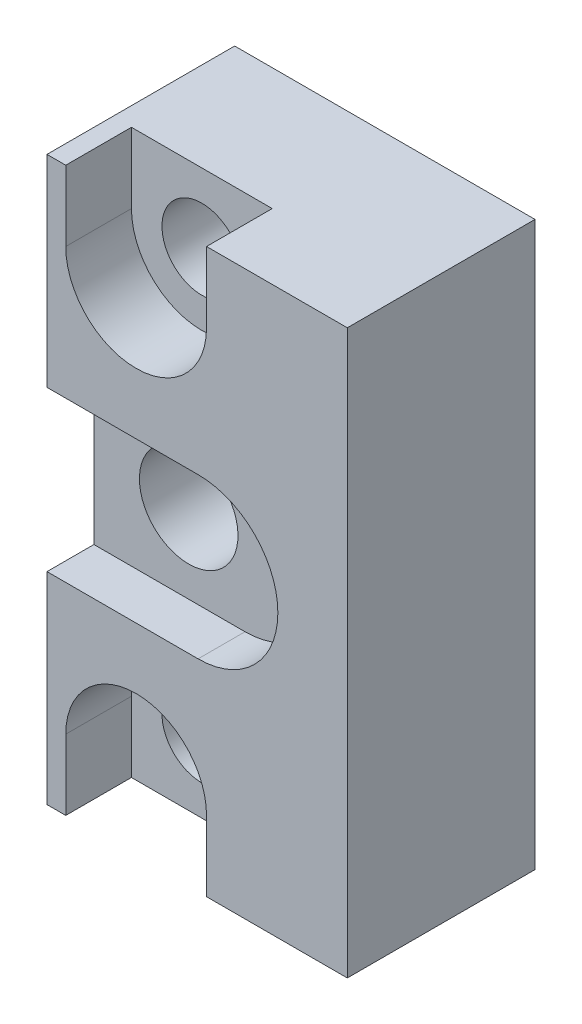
ISO-10303-21;
HEADER;
FILE_DESCRIPTION(('STEP AP214'),'2;1');
FILE_NAME('part.step','',(''),(''),'','','');
FILE_SCHEMA(('AUTOMOTIVE_DESIGN { 1 0 10303 214 1 1 1 1 }'));
ENDSEC;
DATA;
#1=APPLICATION_CONTEXT('core data for automotive mechanical design processes');
#2=APPLICATION_PROTOCOL_DEFINITION('international standard','automotive_design',2000,#1);
#3=PRODUCT_CONTEXT('',#1,'mechanical');
#4=PRODUCT('Part','Part','',(#3));
#5=PRODUCT_RELATED_PRODUCT_CATEGORY('part','',(#4));
#6=PRODUCT_DEFINITION_FORMATION('','',#4);
#7=PRODUCT_DEFINITION_CONTEXT('part definition',#1,'design');
#8=PRODUCT_DEFINITION('design','',#6,#7);
#9=PRODUCT_DEFINITION_SHAPE('','',#8);
#10=(LENGTH_UNIT() NAMED_UNIT(*) SI_UNIT(.MILLI.,.METRE.));
#11=(NAMED_UNIT(*) PLANE_ANGLE_UNIT() SI_UNIT($,.RADIAN.));
#12=(NAMED_UNIT(*) SI_UNIT($,.STERADIAN.) SOLID_ANGLE_UNIT());
#13=UNCERTAINTY_MEASURE_WITH_UNIT(LENGTH_MEASURE(1.E-05),#10,'distance_accuracy_value','');
#14=(GEOMETRIC_REPRESENTATION_CONTEXT(3) GLOBAL_UNCERTAINTY_ASSIGNED_CONTEXT((#13)) GLOBAL_UNIT_ASSIGNED_CONTEXT((#10,
#11,#12)) REPRESENTATION_CONTEXT('',''));
#15=CARTESIAN_POINT('',(0.,0.,0.));
#16=DIRECTION('',(0.,0.,1.));
#17=DIRECTION('',(1.,0.,0.));
#18=AXIS2_PLACEMENT_3D('',#15,#16,#17);
#19=CARTESIAN_POINT('',(308.084985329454,-200.,249.522770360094));
#20=DIRECTION('',(0.,0.,1.));
#21=DIRECTION('',(1.,0.,0.));
#22=AXIS2_PLACEMENT_3D('',#19,#20,#21);
#23=CYLINDRICAL_SURFACE('',#22,5.25);
#24=CARTESIAN_POINT('',(308.084985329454,-200.,242.8));
#25=DIRECTION('',(0.,0.,-1.));
#26=DIRECTION('',(0.,-1.,0.));
#27=AXIS2_PLACEMENT_3D('',#24,#25,#26);
#28=CIRCLE('',#27,5.25);
#29=CARTESIAN_POINT('',(308.084985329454,-205.25,242.8));
#30=VERTEX_POINT('',#29);
#31=EDGE_CURVE('E141',#30,#30,#28,.T.);
#32=ORIENTED_EDGE('',*,*,#31,.F.);
#33=EDGE_LOOP('',(#32));
#34=FACE_BOUND('',#33,.T.);
#35=CARTESIAN_POINT('',(308.084985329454,-200.,234.8));
#36=DIRECTION('',(0.,0.,1.));
#37=DIRECTION('',(0.,-1.,0.));
#38=AXIS2_PLACEMENT_3D('',#35,#36,#37);
#39=CIRCLE('',#38,5.25);
#40=CARTESIAN_POINT('',(308.084985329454,-205.25,234.8));
#41=VERTEX_POINT('',#40);
#42=EDGE_CURVE('E282',#41,#41,#39,.T.);
#43=ORIENTED_EDGE('',*,*,#42,.F.);
#44=EDGE_LOOP('',(#43));
#45=FACE_BOUND('',#44,.T.);
#46=ADVANCED_FACE('F16',(#34,#45),#23,.F.);
#47=CARTESIAN_POINT('',(308.084985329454,-200.,231.05));
#48=DIRECTION('',(0.,0.,1.));
#49=DIRECTION('',(1.,0.,0.));
#50=AXIS2_PLACEMENT_3D('',#47,#48,#49);
#51=CYLINDRICAL_SURFACE('',#50,9.);
#52=CARTESIAN_POINT('',(308.084985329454,-200.,234.8));
#53=DIRECTION('',(0.,0.,1.));
#54=DIRECTION('',(1.,0.,0.));
#55=AXIS2_PLACEMENT_3D('',#52,#53,#54);
#56=CIRCLE('',#55,9.);
#57=CARTESIAN_POINT('',(317.084985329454,-200.,234.8));
#58=VERTEX_POINT('',#57);
#59=EDGE_CURVE('E10',#58,#58,#56,.T.);
#60=ORIENTED_EDGE('',*,*,#59,.T.);
#61=EDGE_LOOP('',(#60));
#62=FACE_BOUND('',#61,.T.);
#63=CARTESIAN_POINT('',(308.084985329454,-200.,227.8));
#64=DIRECTION('',(0.,0.,1.));
#65=DIRECTION('',(1.,0.,0.));
#66=AXIS2_PLACEMENT_3D('',#63,#64,#65);
#67=CIRCLE('',#66,9.);
#68=CARTESIAN_POINT('',(317.084985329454,-200.,227.8));
#69=VERTEX_POINT('',#68);
#70=EDGE_CURVE('E175',#69,#69,#67,.T.);
#71=ORIENTED_EDGE('',*,*,#70,.F.);
#72=EDGE_LOOP('',(#71));
#73=FACE_BOUND('',#72,.T.);
#74=ADVANCED_FACE('F290',(#62,#73),#51,.F.);
#75=CARTESIAN_POINT('',(307.484985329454,-222.5,214.289000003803));
#76=DIRECTION('',(0.,0.,1.));
#77=DIRECTION('',(1.,0.,0.));
#78=AXIS2_PLACEMENT_3D('',#75,#76,#77);
#79=CYLINDRICAL_SURFACE('',#78,4.25);
#80=CARTESIAN_POINT('',(307.484985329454,-222.5,240.8));
#81=DIRECTION('',(0.,0.,1.));
#82=DIRECTION('',(1.,0.,0.));
#83=AXIS2_PLACEMENT_3D('',#80,#81,#82);
#84=CIRCLE('',#83,4.25);
#85=CARTESIAN_POINT('',(311.734985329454,-222.5,240.8));
#86=VERTEX_POINT('',#85);
#87=EDGE_CURVE('E26',#86,#86,#84,.T.);
#88=ORIENTED_EDGE('',*,*,#87,.T.);
#89=EDGE_LOOP('',(#88));
#90=FACE_BOUND('',#89,.T.);
#91=CARTESIAN_POINT('',(307.484985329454,-222.5,227.8));
#92=DIRECTION('',(0.,0.,1.));
#93=DIRECTION('',(1.,0.,0.));
#94=AXIS2_PLACEMENT_3D('',#91,#92,#93);
#95=CIRCLE('',#94,4.25);
#96=CARTESIAN_POINT('',(311.734985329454,-222.5,227.8));
#97=VERTEX_POINT('',#96);
#98=EDGE_CURVE('E198',#97,#97,#95,.T.);
#99=ORIENTED_EDGE('',*,*,#98,.F.);
#100=EDGE_LOOP('',(#99));
#101=FACE_BOUND('',#100,.T.);
#102=ADVANCED_FACE('F311',(#90,#101),#79,.F.);
#103=CARTESIAN_POINT('',(307.484985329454,-177.5,210.428956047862));
#104=DIRECTION('',(0.,0.,1.));
#105=DIRECTION('',(1.,0.,0.));
#106=AXIS2_PLACEMENT_3D('',#103,#104,#105);
#107=CYLINDRICAL_SURFACE('',#106,4.25);
#108=CARTESIAN_POINT('',(307.484985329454,-177.5,240.8));
#109=DIRECTION('',(0.,0.,1.));
#110=DIRECTION('',(1.,0.,0.));
#111=AXIS2_PLACEMENT_3D('',#108,#109,#110);
#112=CIRCLE('',#111,4.25);
#113=CARTESIAN_POINT('',(311.734985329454,-177.5,240.8));
#114=VERTEX_POINT('',#113);
#115=EDGE_CURVE('E268',#114,#114,#112,.T.);
#116=ORIENTED_EDGE('',*,*,#115,.T.);
#117=EDGE_LOOP('',(#116));
#118=FACE_BOUND('',#117,.T.);
#119=CARTESIAN_POINT('',(307.484985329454,-177.5,227.8));
#120=DIRECTION('',(0.,0.,1.));
#121=DIRECTION('',(1.,0.,0.));
#122=AXIS2_PLACEMENT_3D('',#119,#120,#121);
#123=CIRCLE('',#122,4.25);
#124=CARTESIAN_POINT('',(311.734985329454,-177.5,227.8));
#125=VERTEX_POINT('',#124);
#126=EDGE_CURVE('E271',#125,#125,#123,.T.);
#127=ORIENTED_EDGE('',*,*,#126,.F.);
#128=EDGE_LOOP('',(#127));
#129=FACE_BOUND('',#128,.T.);
#130=ADVANCED_FACE('F307',(#118,#129),#107,.F.);
#131=CARTESIAN_POINT('',(314.984985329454,-230.,244.3));
#132=DIRECTION('',(1.,0.,0.));
#133=DIRECTION('',(0.,0.,-1.));
#134=AXIS2_PLACEMENT_3D('',#131,#132,#133);
#135=PLANE('',#134);
#136=DIRECTION('',(0.,-1.,0.));
#137=VECTOR('',#136,1.);
#138=CARTESIAN_POINT('',(314.984985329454,-222.5,247.8));
#139=LINE('',#138,#137);
#140=CARTESIAN_POINT('',(314.984985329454,-222.5,247.8));
#141=VERTEX_POINT('',#140);
#142=CARTESIAN_POINT('',(314.984985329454,-230.,247.8));
#143=VERTEX_POINT('',#142);
#144=EDGE_CURVE('E222',#141,#143,#139,.T.);
#145=ORIENTED_EDGE('',*,*,#144,.F.);
#146=DIRECTION('',(0.,0.,1.));
#147=VECTOR('',#146,1.);
#148=CARTESIAN_POINT('',(314.984985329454,-222.5,240.8));
#149=LINE('',#148,#147);
#150=CARTESIAN_POINT('',(314.984985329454,-222.499999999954,240.8));
#151=VERTEX_POINT('',#150);
#152=EDGE_CURVE('E35',#151,#141,#149,.T.);
#153=ORIENTED_EDGE('',*,*,#152,.F.);
#154=DIRECTION('',(0.,-1.,0.));
#155=VECTOR('',#154,1.);
#156=CARTESIAN_POINT('',(314.984985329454,-222.499999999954,240.8));
#157=LINE('',#156,#155);
#158=CARTESIAN_POINT('',(314.984985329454,-230.,240.8));
#159=VERTEX_POINT('',#158);
#160=EDGE_CURVE('E253',#151,#159,#157,.T.);
#161=ORIENTED_EDGE('',*,*,#160,.T.);
#162=DIRECTION('',(0.,0.,-1.));
#163=VECTOR('',#162,1.);
#164=CARTESIAN_POINT('',(314.984985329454,-230.,247.8));
#165=LINE('',#164,#163);
#166=EDGE_CURVE('E238',#143,#159,#165,.T.);
#167=ORIENTED_EDGE('',*,*,#166,.F.);
#168=EDGE_LOOP('',(#145,#153,#161,#167));
#169=FACE_BOUND('',#168,.T.);
#170=ADVANCED_FACE('F310',(#169),#135,.F.);
#171=CARTESIAN_POINT('',(299.984985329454,-230.,244.3));
#172=DIRECTION('',(-1.,0.,0.));
#173=DIRECTION('',(0.,0.,1.));
#174=AXIS2_PLACEMENT_3D('',#171,#172,#173);
#175=PLANE('',#174);
#176=DIRECTION('',(0.,1.,0.));
#177=VECTOR('',#176,1.);
#178=CARTESIAN_POINT('',(299.984985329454,-230.,247.8));
#179=LINE('',#178,#177);
#180=CARTESIAN_POINT('',(299.984985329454,-230.,247.8));
#181=VERTEX_POINT('',#180);
#182=CARTESIAN_POINT('',(299.984985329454,-222.500000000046,247.8));
#183=VERTEX_POINT('',#182);
#184=EDGE_CURVE('E196',#181,#183,#179,.T.);
#185=ORIENTED_EDGE('',*,*,#184,.F.);
#186=DIRECTION('',(0.,0.,1.));
#187=VECTOR('',#186,1.);
#188=CARTESIAN_POINT('',(299.984985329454,-230.,240.8));
#189=LINE('',#188,#187);
#190=CARTESIAN_POINT('',(299.984985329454,-230.,240.8));
#191=VERTEX_POINT('',#190);
#192=EDGE_CURVE('E234',#191,#181,#189,.T.);
#193=ORIENTED_EDGE('',*,*,#192,.F.);
#194=DIRECTION('',(0.,-1.,0.));
#195=VECTOR('',#194,1.);
#196=CARTESIAN_POINT('',(299.984985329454,-222.500000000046,240.8));
#197=LINE('',#196,#195);
#198=CARTESIAN_POINT('',(299.984985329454,-222.500000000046,240.8));
#199=VERTEX_POINT('',#198);
#200=EDGE_CURVE('E246',#199,#191,#197,.T.);
#201=ORIENTED_EDGE('',*,*,#200,.F.);
#202=DIRECTION('',(0.,0.,-1.));
#203=VECTOR('',#202,1.);
#204=CARTESIAN_POINT('',(299.984985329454,-222.500000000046,247.8));
#205=LINE('',#204,#203);
#206=EDGE_CURVE('E241',#183,#199,#205,.T.);
#207=ORIENTED_EDGE('',*,*,#206,.F.);
#208=EDGE_LOOP('',(#185,#193,#201,#207));
#209=FACE_BOUND('',#208,.T.);
#210=ADVANCED_FACE('F397',(#209),#175,.F.);
#211=CARTESIAN_POINT('',(314.984985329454,-165.504139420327,240.8));
#212=DIRECTION('',(1.,0.,0.));
#213=DIRECTION('',(0.,0.,-1.));
#214=AXIS2_PLACEMENT_3D('',#211,#212,#213);
#215=PLANE('',#214);
#216=DIRECTION('',(0.,-1.,0.));
#217=VECTOR('',#216,1.);
#218=CARTESIAN_POINT('',(314.984985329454,-170.,247.8));
#219=LINE('',#218,#217);
#220=CARTESIAN_POINT('',(314.984985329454,-170.,247.8));
#221=VERTEX_POINT('',#220);
#222=CARTESIAN_POINT('',(314.984985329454,-177.5,247.8));
#223=VERTEX_POINT('',#222);
#224=EDGE_CURVE('E213',#221,#223,#219,.T.);
#225=ORIENTED_EDGE('',*,*,#224,.F.);
#226=DIRECTION('',(0.,0.,1.));
#227=VECTOR('',#226,1.);
#228=CARTESIAN_POINT('',(314.984985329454,-170.,240.8));
#229=LINE('',#228,#227);
#230=CARTESIAN_POINT('',(314.984985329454,-170.,240.8));
#231=VERTEX_POINT('',#230);
#232=EDGE_CURVE('E215',#231,#221,#229,.T.);
#233=ORIENTED_EDGE('',*,*,#232,.F.);
#234=DIRECTION('',(0.,1.,0.));
#235=VECTOR('',#234,1.);
#236=CARTESIAN_POINT('',(314.984985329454,-177.500000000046,240.8));
#237=LINE('',#236,#235);
#238=CARTESIAN_POINT('',(314.984985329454,-177.500000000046,240.8));
#239=VERTEX_POINT('',#238);
#240=EDGE_CURVE('E189',#239,#231,#237,.T.);
#241=ORIENTED_EDGE('',*,*,#240,.F.);
#242=DIRECTION('',(0.,0.,1.));
#243=VECTOR('',#242,1.);
#244=CARTESIAN_POINT('',(314.984985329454,-177.5,240.8));
#245=LINE('',#244,#243);
#246=EDGE_CURVE('E245',#239,#223,#245,.T.);
#247=ORIENTED_EDGE('',*,*,#246,.T.);
#248=EDGE_LOOP('',(#225,#233,#241,#247));
#249=FACE_BOUND('',#248,.T.);
#250=ADVANCED_FACE('F350',(#249),#215,.F.);
#251=CARTESIAN_POINT('',(299.984985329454,-177.499999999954,240.8));
#252=DIRECTION('',(-1.,0.,0.));
#253=DIRECTION('',(0.,0.,1.));
#254=AXIS2_PLACEMENT_3D('',#251,#252,#253);
#255=PLANE('',#254);
#256=DIRECTION('',(0.,0.,-1.));
#257=VECTOR('',#256,1.);
#258=CARTESIAN_POINT('',(299.984985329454,-170.,247.8));
#259=LINE('',#258,#257);
#260=CARTESIAN_POINT('',(299.984985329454,-170.,247.8));
#261=VERTEX_POINT('',#260);
#262=CARTESIAN_POINT('',(299.984985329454,-170.,240.8));
#263=VERTEX_POINT('',#262);
#264=EDGE_CURVE('E192',#261,#263,#259,.T.);
#265=ORIENTED_EDGE('',*,*,#264,.F.);
#266=DIRECTION('',(0.,1.,0.));
#267=VECTOR('',#266,1.);
#268=CARTESIAN_POINT('',(299.984985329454,-177.499999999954,247.8));
#269=LINE('',#268,#267);
#270=CARTESIAN_POINT('',(299.984985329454,-177.499999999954,247.8));
#271=VERTEX_POINT('',#270);
#272=EDGE_CURVE('E205',#271,#261,#269,.T.);
#273=ORIENTED_EDGE('',*,*,#272,.F.);
#274=DIRECTION('',(0.,0.,1.));
#275=VECTOR('',#274,1.);
#276=CARTESIAN_POINT('',(299.984985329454,-177.499999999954,240.8));
#277=LINE('',#276,#275);
#278=CARTESIAN_POINT('',(299.984985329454,-177.499999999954,240.8));
#279=VERTEX_POINT('',#278);
#280=EDGE_CURVE('E185',#279,#271,#277,.T.);
#281=ORIENTED_EDGE('',*,*,#280,.F.);
#282=DIRECTION('',(0.,1.,0.));
#283=VECTOR('',#282,1.);
#284=CARTESIAN_POINT('',(299.984985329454,-177.499999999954,240.8));
#285=LINE('',#284,#283);
#286=EDGE_CURVE('E242',#279,#263,#285,.T.);
#287=ORIENTED_EDGE('',*,*,#286,.T.);
#288=EDGE_LOOP('',(#265,#273,#281,#287));
#289=FACE_BOUND('',#288,.T.);
#290=ADVANCED_FACE('F364',(#289),#255,.F.);
#291=CARTESIAN_POINT('',(301.634985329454,-222.5,240.8));
#292=DIRECTION('',(0.,0.,-1.));
#293=DIRECTION('',(-1.,0.,0.));
#294=AXIS2_PLACEMENT_3D('',#291,#292,#293);
#295=PLANE('',#294);
#296=CARTESIAN_POINT('',(307.484985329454,-222.5,240.8));
#297=DIRECTION('',(0.,0.,-1.));
#298=DIRECTION('',(0.,-1.,0.));
#299=AXIS2_PLACEMENT_3D('',#296,#297,#298);
#300=CIRCLE('',#299,7.5);
#301=EDGE_CURVE('E239',#199,#151,#300,.T.);
#302=ORIENTED_EDGE('',*,*,#301,.F.);
#303=ORIENTED_EDGE('',*,*,#200,.T.);
#304=DIRECTION('',(-1.,0.,0.));
#305=VECTOR('',#304,1.);
#306=CARTESIAN_POINT('',(314.984985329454,-230.,240.8));
#307=LINE('',#306,#305);
#308=EDGE_CURVE('E235',#159,#191,#307,.T.);
#309=ORIENTED_EDGE('',*,*,#308,.F.);
#310=ORIENTED_EDGE('',*,*,#160,.F.);
#311=EDGE_LOOP('',(#302,#303,#309,#310));
#312=FACE_BOUND('',#311,.T.);
#313=ORIENTED_EDGE('',*,*,#87,.F.);
#314=EDGE_LOOP('',(#313));
#315=FACE_BOUND('',#314,.T.);
#316=ADVANCED_FACE('F388',(#312,#315),#295,.F.);
#317=CARTESIAN_POINT('',(313.984985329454,-230.,237.8));
#318=DIRECTION('',(0.,1.,0.));
#319=DIRECTION('',(0.,0.,1.));
#320=AXIS2_PLACEMENT_3D('',#317,#318,#319);
#321=PLANE('',#320);
#322=ORIENTED_EDGE('',*,*,#166,.T.);
#323=ORIENTED_EDGE('',*,*,#308,.T.);
#324=ORIENTED_EDGE('',*,*,#192,.T.);
#325=DIRECTION('',(-1.,0.,0.));
#326=VECTOR('',#325,1.);
#327=CARTESIAN_POINT('',(299.984985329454,-230.,247.8));
#328=LINE('',#327,#326);
#329=CARTESIAN_POINT('',(297.984985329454,-230.,247.8));
#330=VERTEX_POINT('',#329);
#331=EDGE_CURVE('E231',#181,#330,#328,.T.);
#332=ORIENTED_EDGE('',*,*,#331,.T.);
#333=DIRECTION('',(0.,0.,-1.));
#334=VECTOR('',#333,1.);
#335=CARTESIAN_POINT('',(297.984985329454,-230.,247.8));
#336=LINE('',#335,#334);
#337=CARTESIAN_POINT('',(297.984985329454,-230.,227.8));
#338=VERTEX_POINT('',#337);
#339=EDGE_CURVE('E228',#330,#338,#336,.T.);
#340=ORIENTED_EDGE('',*,*,#339,.T.);
#341=DIRECTION('',(1.,0.,0.));
#342=VECTOR('',#341,1.);
#343=CARTESIAN_POINT('',(297.984985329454,-230.,227.8));
#344=LINE('',#343,#342);
#345=CARTESIAN_POINT('',(329.984985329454,-230.,227.8));
#346=VERTEX_POINT('',#345);
#347=EDGE_CURVE('E225',#338,#346,#344,.T.);
#348=ORIENTED_EDGE('',*,*,#347,.T.);
#349=DIRECTION('',(0.,0.,1.));
#350=VECTOR('',#349,1.);
#351=CARTESIAN_POINT('',(329.984985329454,-230.,227.8));
#352=LINE('',#351,#350);
#353=CARTESIAN_POINT('',(329.984985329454,-230.,247.8));
#354=VERTEX_POINT('',#353);
#355=EDGE_CURVE('E221',#346,#354,#352,.T.);
#356=ORIENTED_EDGE('',*,*,#355,.T.);
#357=DIRECTION('',(-1.,0.,0.));
#358=VECTOR('',#357,1.);
#359=CARTESIAN_POINT('',(329.984985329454,-230.,247.8));
#360=LINE('',#359,#358);
#361=EDGE_CURVE('E218',#354,#143,#360,.T.);
#362=ORIENTED_EDGE('',*,*,#361,.T.);
#363=EDGE_LOOP('',(#322,#323,#324,#332,#340,#348,#356,#362));
#364=FACE_BOUND('',#363,.T.);
#365=ADVANCED_FACE('F385',(#364),#321,.F.);
#366=CARTESIAN_POINT('',(313.984985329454,-215.,247.8));
#367=DIRECTION('',(0.,0.,1.));
#368=DIRECTION('',(1.,0.,0.));
#369=AXIS2_PLACEMENT_3D('',#366,#367,#368);
#370=PLANE('',#369);
#371=ORIENTED_EDGE('',*,*,#144,.T.);
#372=ORIENTED_EDGE('',*,*,#361,.F.);
#373=DIRECTION('',(0.,-1.,0.));
#374=VECTOR('',#373,1.);
#375=CARTESIAN_POINT('',(329.984985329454,-170.,247.8));
#376=LINE('',#375,#374);
#377=CARTESIAN_POINT('',(329.984985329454,-170.,247.8));
#378=VERTEX_POINT('',#377);
#379=EDGE_CURVE('E178',#378,#354,#376,.T.);
#380=ORIENTED_EDGE('',*,*,#379,.F.);
#381=DIRECTION('',(1.,0.,0.));
#382=VECTOR('',#381,1.);
#383=CARTESIAN_POINT('',(314.984985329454,-170.,247.8));
#384=LINE('',#383,#382);
#385=EDGE_CURVE('E162',#221,#378,#384,.T.);
#386=ORIENTED_EDGE('',*,*,#385,.F.);
#387=ORIENTED_EDGE('',*,*,#224,.T.);
#388=CARTESIAN_POINT('',(307.484985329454,-177.5,247.8));
#389=DIRECTION('',(0.,0.,-1.));
#390=DIRECTION('',(1.,0.,0.));
#391=AXIS2_PLACEMENT_3D('',#388,#389,#390);
#392=CIRCLE('',#391,7.5);
#393=EDGE_CURVE('E210',#223,#271,#392,.T.);
#394=ORIENTED_EDGE('',*,*,#393,.T.);
#395=ORIENTED_EDGE('',*,*,#272,.T.);
#396=DIRECTION('',(1.,0.,0.));
#397=VECTOR('',#396,1.);
#398=CARTESIAN_POINT('',(297.984985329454,-170.,247.8));
#399=LINE('',#398,#397);
#400=CARTESIAN_POINT('',(297.984985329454,-170.,247.8));
#401=VERTEX_POINT('',#400);
#402=EDGE_CURVE('E163',#401,#261,#399,.T.);
#403=ORIENTED_EDGE('',*,*,#402,.F.);
#404=DIRECTION('',(0.,1.,0.));
#405=VECTOR('',#404,1.);
#406=CARTESIAN_POINT('',(297.984985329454,-191.5,247.8));
#407=LINE('',#406,#405);
#408=CARTESIAN_POINT('',(297.984985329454,-191.5,247.8));
#409=VERTEX_POINT('',#408);
#410=EDGE_CURVE('E156',#409,#401,#407,.T.);
#411=ORIENTED_EDGE('',*,*,#410,.F.);
#412=DIRECTION('',(1.,0.,0.));
#413=VECTOR('',#412,1.);
#414=CARTESIAN_POINT('',(314.084985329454,-191.5,247.8));
#415=LINE('',#414,#413);
#416=CARTESIAN_POINT('',(314.084985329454,-191.5,247.8));
#417=VERTEX_POINT('',#416);
#418=EDGE_CURVE('E203',#409,#417,#415,.T.);
#419=ORIENTED_EDGE('',*,*,#418,.T.);
#420=CARTESIAN_POINT('',(314.084985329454,-200.,247.8));
#421=DIRECTION('',(0.,0.,-1.));
#422=DIRECTION('',(1.,0.,0.));
#423=AXIS2_PLACEMENT_3D('',#420,#421,#422);
#424=CIRCLE('',#423,8.5);
#425=CARTESIAN_POINT('',(314.084985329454,-208.5,247.8));
#426=VERTEX_POINT('',#425);
#427=EDGE_CURVE('E146',#417,#426,#424,.T.);
#428=ORIENTED_EDGE('',*,*,#427,.T.);
#429=DIRECTION('',(-1.,0.,0.));
#430=VECTOR('',#429,1.);
#431=CARTESIAN_POINT('',(297.984985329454,-208.5,247.8));
#432=LINE('',#431,#430);
#433=CARTESIAN_POINT('',(297.984985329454,-208.5,247.8));
#434=VERTEX_POINT('',#433);
#435=EDGE_CURVE('E199',#426,#434,#432,.T.);
#436=ORIENTED_EDGE('',*,*,#435,.T.);
#437=DIRECTION('',(0.,1.,0.));
#438=VECTOR('',#437,1.);
#439=CARTESIAN_POINT('',(297.984985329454,-230.,247.8));
#440=LINE('',#439,#438);
#441=EDGE_CURVE('E170',#330,#434,#440,.T.);
#442=ORIENTED_EDGE('',*,*,#441,.F.);
#443=ORIENTED_EDGE('',*,*,#331,.F.);
#444=ORIENTED_EDGE('',*,*,#184,.T.);
#445=CARTESIAN_POINT('',(307.484985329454,-222.5,247.8));
#446=DIRECTION('',(0.,0.,-1.));
#447=DIRECTION('',(1.,0.,0.));
#448=AXIS2_PLACEMENT_3D('',#445,#446,#447);
#449=CIRCLE('',#448,7.50000000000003);
#450=EDGE_CURVE('E193',#183,#141,#449,.T.);
#451=ORIENTED_EDGE('',*,*,#450,.T.);
#452=EDGE_LOOP('',(#371,#372,#380,#386,#387,#394,#395,#403,#411,#419,#428,#436,#442,#443,#444,#451));
#453=FACE_BOUND('',#452,.T.);
#454=ADVANCED_FACE('F354',(#453),#370,.T.);
#455=CARTESIAN_POINT('',(301.634985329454,-177.5,240.8));
#456=DIRECTION('',(0.,0.,-1.));
#457=DIRECTION('',(-1.,0.,0.));
#458=AXIS2_PLACEMENT_3D('',#455,#456,#457);
#459=PLANE('',#458);
#460=DIRECTION('',(1.,0.,0.));
#461=VECTOR('',#460,1.);
#462=CARTESIAN_POINT('',(299.984985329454,-170.,240.8));
#463=LINE('',#462,#461);
#464=EDGE_CURVE('E140',#263,#231,#463,.T.);
#465=ORIENTED_EDGE('',*,*,#464,.F.);
#466=ORIENTED_EDGE('',*,*,#286,.F.);
#467=CARTESIAN_POINT('',(307.484985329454,-177.5,240.8));
#468=DIRECTION('',(0.,0.,-1.));
#469=DIRECTION('',(0.,-1.,0.));
#470=AXIS2_PLACEMENT_3D('',#467,#468,#469);
#471=CIRCLE('',#470,7.5);
#472=EDGE_CURVE('E186',#239,#279,#471,.T.);
#473=ORIENTED_EDGE('',*,*,#472,.F.);
#474=ORIENTED_EDGE('',*,*,#240,.T.);
#475=EDGE_LOOP('',(#465,#466,#473,#474));
#476=FACE_BOUND('',#475,.T.);
#477=ORIENTED_EDGE('',*,*,#115,.F.);
#478=EDGE_LOOP('',(#477));
#479=FACE_BOUND('',#478,.T.);
#480=ADVANCED_FACE('F322',(#476,#479),#459,.F.);
#481=CARTESIAN_POINT('',(307.484985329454,-177.5,243.8));
#482=DIRECTION('',(0.,0.,-1.));
#483=DIRECTION('',(0.,-1.,0.));
#484=AXIS2_PLACEMENT_3D('',#481,#482,#483);
#485=CYLINDRICAL_SURFACE('',#484,7.5);
#486=ORIENTED_EDGE('',*,*,#246,.F.);
#487=ORIENTED_EDGE('',*,*,#472,.T.);
#488=ORIENTED_EDGE('',*,*,#280,.T.);
#489=ORIENTED_EDGE('',*,*,#393,.F.);
#490=EDGE_LOOP('',(#486,#487,#488,#489));
#491=FACE_BOUND('',#490,.T.);
#492=ADVANCED_FACE('F319',(#491),#485,.F.);
#493=CARTESIAN_POINT('',(329.984985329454,-155.,227.8));
#494=DIRECTION('',(1.,0.,0.));
#495=DIRECTION('',(0.,0.,-1.));
#496=AXIS2_PLACEMENT_3D('',#493,#494,#495);
#497=PLANE('',#496);
#498=ORIENTED_EDGE('',*,*,#355,.F.);
#499=DIRECTION('',(0.,1.,0.));
#500=VECTOR('',#499,1.);
#501=CARTESIAN_POINT('',(329.984985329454,-230.,227.8));
#502=LINE('',#501,#500);
#503=CARTESIAN_POINT('',(329.984985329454,-170.,227.8));
#504=VERTEX_POINT('',#503);
#505=EDGE_CURVE('E182',#346,#504,#502,.T.);
#506=ORIENTED_EDGE('',*,*,#505,.T.);
#507=DIRECTION('',(0.,0.,1.));
#508=VECTOR('',#507,1.);
#509=CARTESIAN_POINT('',(329.984985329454,-170.,227.8));
#510=LINE('',#509,#508);
#511=EDGE_CURVE('E179',#504,#378,#510,.T.);
#512=ORIENTED_EDGE('',*,*,#511,.T.);
#513=ORIENTED_EDGE('',*,*,#379,.T.);
#514=EDGE_LOOP('',(#498,#506,#512,#513));
#515=FACE_BOUND('',#514,.T.);
#516=ADVANCED_FACE('F321',(#515),#497,.T.);
#517=CARTESIAN_POINT('',(313.984985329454,-200.,227.8));
#518=DIRECTION('',(0.,0.,1.));
#519=DIRECTION('',(1.,0.,0.));
#520=AXIS2_PLACEMENT_3D('',#517,#518,#519);
#521=PLANE('',#520);
#522=ORIENTED_EDGE('',*,*,#347,.F.);
#523=DIRECTION('',(0.,1.,0.));
#524=VECTOR('',#523,1.);
#525=CARTESIAN_POINT('',(297.984985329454,-230.,227.8));
#526=LINE('',#525,#524);
#527=CARTESIAN_POINT('',(297.984985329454,-170.,227.8));
#528=VERTEX_POINT('',#527);
#529=EDGE_CURVE('E174',#338,#528,#526,.T.);
#530=ORIENTED_EDGE('',*,*,#529,.T.);
#531=DIRECTION('',(1.,0.,0.));
#532=VECTOR('',#531,1.);
#533=CARTESIAN_POINT('',(297.984985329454,-170.,227.8));
#534=LINE('',#533,#532);
#535=EDGE_CURVE('E171',#528,#504,#534,.T.);
#536=ORIENTED_EDGE('',*,*,#535,.T.);
#537=ORIENTED_EDGE('',*,*,#505,.F.);
#538=EDGE_LOOP('',(#522,#530,#536,#537));
#539=FACE_BOUND('',#538,.T.);
#540=ORIENTED_EDGE('',*,*,#70,.T.);
#541=EDGE_LOOP('',(#540));
#542=FACE_BOUND('',#541,.T.);
#543=ORIENTED_EDGE('',*,*,#126,.T.);
#544=EDGE_LOOP('',(#543));
#545=FACE_BOUND('',#544,.T.);
#546=ORIENTED_EDGE('',*,*,#98,.T.);
#547=EDGE_LOOP('',(#546));
#548=FACE_BOUND('',#547,.T.);
#549=ADVANCED_FACE('F336',(#539,#542,#545,#548),#521,.F.);
#550=CARTESIAN_POINT('',(297.984985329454,-245.,227.8));
#551=DIRECTION('',(-1.,0.,0.));
#552=DIRECTION('',(0.,0.,1.));
#553=AXIS2_PLACEMENT_3D('',#550,#551,#552);
#554=PLANE('',#553);
#555=ORIENTED_EDGE('',*,*,#339,.F.);
#556=ORIENTED_EDGE('',*,*,#441,.T.);
#557=DIRECTION('',(0.,0.,-1.));
#558=VECTOR('',#557,1.);
#559=CARTESIAN_POINT('',(297.984985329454,-208.5,247.8));
#560=LINE('',#559,#558);
#561=CARTESIAN_POINT('',(297.984985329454,-208.5,242.8));
#562=VERTEX_POINT('',#561);
#563=EDGE_CURVE('E167',#434,#562,#560,.T.);
#564=ORIENTED_EDGE('',*,*,#563,.T.);
#565=DIRECTION('',(0.,1.,0.));
#566=VECTOR('',#565,1.);
#567=CARTESIAN_POINT('',(297.984985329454,-208.5,242.8));
#568=LINE('',#567,#566);
#569=CARTESIAN_POINT('',(297.984985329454,-191.5,242.8));
#570=VERTEX_POINT('',#569);
#571=EDGE_CURVE('E165',#562,#570,#568,.T.);
#572=ORIENTED_EDGE('',*,*,#571,.T.);
#573=DIRECTION('',(0.,0.,1.));
#574=VECTOR('',#573,1.);
#575=CARTESIAN_POINT('',(297.984985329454,-191.5,242.8));
#576=LINE('',#575,#574);
#577=EDGE_CURVE('E153',#570,#409,#576,.T.);
#578=ORIENTED_EDGE('',*,*,#577,.T.);
#579=ORIENTED_EDGE('',*,*,#410,.T.);
#580=DIRECTION('',(0.,0.,1.));
#581=VECTOR('',#580,1.);
#582=CARTESIAN_POINT('',(297.984985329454,-170.,227.8));
#583=LINE('',#582,#581);
#584=EDGE_CURVE('E159',#528,#401,#583,.T.);
#585=ORIENTED_EDGE('',*,*,#584,.F.);
#586=ORIENTED_EDGE('',*,*,#529,.F.);
#587=EDGE_LOOP('',(#555,#556,#564,#572,#578,#579,#585,#586));
#588=FACE_BOUND('',#587,.T.);
#589=ADVANCED_FACE('F331',(#588),#554,.T.);
#590=CARTESIAN_POINT('',(314.084985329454,-208.5,242.8));
#591=DIRECTION('',(0.,-1.,0.));
#592=DIRECTION('',(0.,0.,-1.));
#593=AXIS2_PLACEMENT_3D('',#590,#591,#592);
#594=PLANE('',#593);
#595=ORIENTED_EDGE('',*,*,#435,.F.);
#596=DIRECTION('',(0.,0.,1.));
#597=VECTOR('',#596,1.);
#598=CARTESIAN_POINT('',(314.084985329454,-208.5,242.8));
#599=LINE('',#598,#597);
#600=CARTESIAN_POINT('',(314.084985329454,-208.5,242.8));
#601=VERTEX_POINT('',#600);
#602=EDGE_CURVE('E127',#601,#426,#599,.T.);
#603=ORIENTED_EDGE('',*,*,#602,.F.);
#604=DIRECTION('',(-1.,0.,0.));
#605=VECTOR('',#604,1.);
#606=CARTESIAN_POINT('',(314.084985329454,-208.5,242.8));
#607=LINE('',#606,#605);
#608=EDGE_CURVE('E138',#601,#562,#607,.T.);
#609=ORIENTED_EDGE('',*,*,#608,.T.);
#610=ORIENTED_EDGE('',*,*,#563,.F.);
#611=EDGE_LOOP('',(#595,#603,#609,#610));
#612=FACE_BOUND('',#611,.T.);
#613=ADVANCED_FACE('F325',(#612),#594,.F.);
#614=CARTESIAN_POINT('',(314.084985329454,-200.,242.8));
#615=DIRECTION('',(0.,0.,1.));
#616=DIRECTION('',(1.,0.,0.));
#617=AXIS2_PLACEMENT_3D('',#614,#615,#616);
#618=CYLINDRICAL_SURFACE('',#617,8.5);
#619=ORIENTED_EDGE('',*,*,#427,.F.);
#620=DIRECTION('',(0.,0.,1.));
#621=VECTOR('',#620,1.);
#622=CARTESIAN_POINT('',(314.084985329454,-191.5,242.8));
#623=LINE('',#622,#621);
#624=CARTESIAN_POINT('',(314.084985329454,-191.5,242.8));
#625=VERTEX_POINT('',#624);
#626=EDGE_CURVE('E143',#625,#417,#623,.T.);
#627=ORIENTED_EDGE('',*,*,#626,.F.);
#628=CARTESIAN_POINT('',(314.084985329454,-200.,242.8));
#629=DIRECTION('',(0.,0.,1.));
#630=DIRECTION('',(1.,0.,0.));
#631=AXIS2_PLACEMENT_3D('',#628,#629,#630);
#632=CIRCLE('',#631,8.5);
#633=EDGE_CURVE('E133',#601,#625,#632,.T.);
#634=ORIENTED_EDGE('',*,*,#633,.F.);
#635=ORIENTED_EDGE('',*,*,#602,.T.);
#636=EDGE_LOOP('',(#619,#627,#634,#635));
#637=FACE_BOUND('',#636,.T.);
#638=ADVANCED_FACE('F144',(#637),#618,.F.);
#639=CARTESIAN_POINT('',(304.584985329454,-191.5,242.8));
#640=DIRECTION('',(0.,1.,0.));
#641=DIRECTION('',(0.,0.,1.));
#642=AXIS2_PLACEMENT_3D('',#639,#640,#641);
#643=PLANE('',#642);
#644=ORIENTED_EDGE('',*,*,#418,.F.);
#645=ORIENTED_EDGE('',*,*,#577,.F.);
#646=DIRECTION('',(1.,0.,0.));
#647=VECTOR('',#646,1.);
#648=CARTESIAN_POINT('',(297.984985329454,-191.5,242.8));
#649=LINE('',#648,#647);
#650=EDGE_CURVE('E20',#570,#625,#649,.T.);
#651=ORIENTED_EDGE('',*,*,#650,.T.);
#652=ORIENTED_EDGE('',*,*,#626,.T.);
#653=EDGE_LOOP('',(#644,#645,#651,#652));
#654=FACE_BOUND('',#653,.T.);
#655=ADVANCED_FACE('F151',(#654),#643,.F.);
#656=CARTESIAN_POINT('',(307.484985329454,-222.5,243.8));
#657=DIRECTION('',(0.,0.,-1.));
#658=DIRECTION('',(0.,-1.,0.));
#659=AXIS2_PLACEMENT_3D('',#656,#657,#658);
#660=CYLINDRICAL_SURFACE('',#659,7.50000000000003);
#661=ORIENTED_EDGE('',*,*,#152,.T.);
#662=ORIENTED_EDGE('',*,*,#450,.F.);
#663=ORIENTED_EDGE('',*,*,#206,.T.);
#664=ORIENTED_EDGE('',*,*,#301,.T.);
#665=EDGE_LOOP('',(#661,#662,#663,#664));
#666=FACE_BOUND('',#665,.T.);
#667=ADVANCED_FACE('F18',(#666),#660,.F.);
#668=CARTESIAN_POINT('',(297.984985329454,-170.,227.8));
#669=DIRECTION('',(0.,1.,0.));
#670=DIRECTION('',(0.,0.,1.));
#671=AXIS2_PLACEMENT_3D('',#668,#669,#670);
#672=PLANE('',#671);
#673=ORIENTED_EDGE('',*,*,#232,.T.);
#674=ORIENTED_EDGE('',*,*,#385,.T.);
#675=ORIENTED_EDGE('',*,*,#511,.F.);
#676=ORIENTED_EDGE('',*,*,#535,.F.);
#677=ORIENTED_EDGE('',*,*,#584,.T.);
#678=ORIENTED_EDGE('',*,*,#402,.T.);
#679=ORIENTED_EDGE('',*,*,#264,.T.);
#680=ORIENTED_EDGE('',*,*,#464,.T.);
#681=EDGE_LOOP('',(#673,#674,#675,#676,#677,#678,#679,#680));
#682=FACE_BOUND('',#681,.T.);
#683=ADVANCED_FACE('F302',(#682),#672,.T.);
#684=CARTESIAN_POINT('',(305.547796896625,-200.,242.8));
#685=DIRECTION('',(0.,0.,1.));
#686=DIRECTION('',(1.,0.,0.));
#687=AXIS2_PLACEMENT_3D('',#684,#685,#686);
#688=PLANE('',#687);
#689=ORIENTED_EDGE('',*,*,#571,.F.);
#690=ORIENTED_EDGE('',*,*,#608,.F.);
#691=ORIENTED_EDGE('',*,*,#633,.T.);
#692=ORIENTED_EDGE('',*,*,#650,.F.);
#693=EDGE_LOOP('',(#689,#690,#691,#692));
#694=FACE_BOUND('',#693,.T.);
#695=ORIENTED_EDGE('',*,*,#31,.T.);
#696=EDGE_LOOP('',(#695));
#697=FACE_BOUND('',#696,.T.);
#698=ADVANCED_FACE('F135',(#694,#697),#688,.T.);
#699=CARTESIAN_POINT('',(308.084985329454,-192.875,234.8));
#700=DIRECTION('',(0.,0.,1.));
#701=DIRECTION('',(1.,0.,0.));
#702=AXIS2_PLACEMENT_3D('',#699,#700,#701);
#703=PLANE('',#702);
#704=ORIENTED_EDGE('',*,*,#59,.F.);
#705=EDGE_LOOP('',(#704));
#706=FACE_BOUND('',#705,.T.);
#707=ORIENTED_EDGE('',*,*,#42,.T.);
#708=EDGE_LOOP('',(#707));
#709=FACE_BOUND('',#708,.T.);
#710=ADVANCED_FACE('F294',(#706,#709),#703,.F.);
#711=CLOSED_SHELL('',(#46,#74,#102,#130,#170,#210,#250,#290,#316,#365,#454,#480,#492,#516,#549,
#589,#613,#638,#655,#667,#683,#698,#710));
#712=MANIFOLD_SOLID_BREP('B1',#711);
#713=ADVANCED_BREP_SHAPE_REPRESENTATION('',(#18,#712),#14);
#714=SHAPE_DEFINITION_REPRESENTATION(#9,#713);
ENDSEC;
END-ISO-10303-21;
